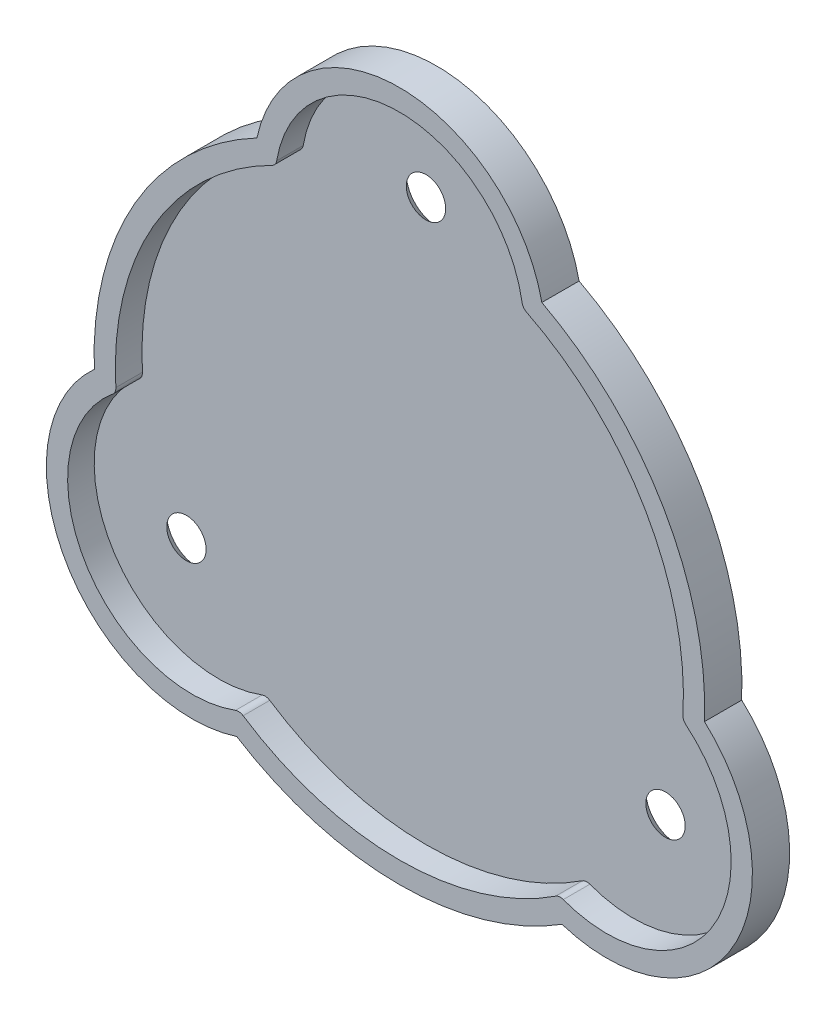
ISO-10303-21;
HEADER;
FILE_DESCRIPTION(('STEP AP214'),'2;1');
FILE_NAME('part.step','',(''),(''),'','','');
FILE_SCHEMA(('AUTOMOTIVE_DESIGN { 1 0 10303 214 1 1 1 1 }'));
ENDSEC;
DATA;
#1=APPLICATION_CONTEXT('core data for automotive mechanical design processes');
#2=APPLICATION_PROTOCOL_DEFINITION('international standard','automotive_design',2000,#1);
#3=PRODUCT_CONTEXT('',#1,'mechanical');
#4=PRODUCT('Part','Part','',(#3));
#5=PRODUCT_RELATED_PRODUCT_CATEGORY('part','',(#4));
#6=PRODUCT_DEFINITION_FORMATION('','',#4);
#7=PRODUCT_DEFINITION_CONTEXT('part definition',#1,'design');
#8=PRODUCT_DEFINITION('design','',#6,#7);
#9=PRODUCT_DEFINITION_SHAPE('','',#8);
#10=(LENGTH_UNIT() NAMED_UNIT(*) SI_UNIT(.MILLI.,.METRE.));
#11=(NAMED_UNIT(*) PLANE_ANGLE_UNIT() SI_UNIT($,.RADIAN.));
#12=(NAMED_UNIT(*) SI_UNIT($,.STERADIAN.) SOLID_ANGLE_UNIT());
#13=UNCERTAINTY_MEASURE_WITH_UNIT(LENGTH_MEASURE(1.E-05),#10,'distance_accuracy_value','');
#14=(GEOMETRIC_REPRESENTATION_CONTEXT(3) GLOBAL_UNCERTAINTY_ASSIGNED_CONTEXT((#13)) GLOBAL_UNIT_ASSIGNED_CONTEXT((#10,
#11,#12)) REPRESENTATION_CONTEXT('',''));
#15=CARTESIAN_POINT('',(0.,0.,0.));
#16=DIRECTION('',(0.,0.,1.));
#17=DIRECTION('',(1.,0.,0.));
#18=AXIS2_PLACEMENT_3D('',#15,#16,#17);
#19=CARTESIAN_POINT('',(1276.73296316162,1096.80329769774,1989.));
#20=DIRECTION('',(0.,0.,-1.));
#21=DIRECTION('',(-1.,0.,0.));
#22=AXIS2_PLACEMENT_3D('',#19,#20,#21);
#23=PLANE('',#22);
#24=CARTESIAN_POINT('',(1289.50683786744,1089.42829769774,1989.));
#25=DIRECTION('',(0.,0.,-1.));
#26=DIRECTION('',(-1.,0.,0.));
#27=AXIS2_PLACEMENT_3D('',#24,#25,#26);
#28=CIRCLE('',#27,2.8499999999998);
#29=CARTESIAN_POINT('',(1286.65683786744,1089.42829769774,1989.));
#30=VERTEX_POINT('',#29);
#31=EDGE_CURVE('E323',#30,#30,#28,.F.);
#32=ORIENTED_EDGE('',*,*,#31,.T.);
#33=EDGE_LOOP('',(#32));
#34=FACE_BOUND('',#33,.T.);
#35=CARTESIAN_POINT('',(1289.50683786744,1089.42829769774,1989.));
#36=DIRECTION('',(0.,0.,-1.));
#37=DIRECTION('',(-1.,0.,0.));
#38=AXIS2_PLACEMENT_3D('',#35,#36,#37);
#39=CIRCLE('',#38,5.25000000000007);
#40=CARTESIAN_POINT('',(1284.25683786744,1089.42829769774,1989.));
#41=VERTEX_POINT('',#40);
#42=EDGE_CURVE('E11',#41,#41,#39,.F.);
#43=ORIENTED_EDGE('',*,*,#42,.F.);
#44=EDGE_LOOP('',(#43));
#45=FACE_BOUND('',#44,.T.);
#46=ADVANCED_FACE('F39',(#34,#45),#23,.T.);
#47=CARTESIAN_POINT('',(1244.47351687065,1089.42829769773,1989.));
#48=DIRECTION('',(0.,0.,-1.));
#49=DIRECTION('',(-1.,0.,0.));
#50=AXIS2_PLACEMENT_3D('',#47,#48,#49);
#51=CIRCLE('',#50,2.8499999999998);
#52=CARTESIAN_POINT('',(1241.62351687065,1089.42829769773,1989.));
#53=VERTEX_POINT('',#52);
#54=EDGE_CURVE('E336',#53,#53,#51,.F.);
#55=ORIENTED_EDGE('',*,*,#54,.T.);
#56=EDGE_LOOP('',(#55));
#57=FACE_BOUND('',#56,.T.);
#58=CARTESIAN_POINT('',(1244.47351687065,1089.42829769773,1989.));
#59=DIRECTION('',(0.,0.,-1.));
#60=DIRECTION('',(-1.,0.,0.));
#61=AXIS2_PLACEMENT_3D('',#58,#59,#60);
#62=CIRCLE('',#61,5.25000000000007);
#63=CARTESIAN_POINT('',(1239.22351687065,1089.42829769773,1989.));
#64=VERTEX_POINT('',#63);
#65=EDGE_CURVE('E48',#64,#64,#62,.F.);
#66=ORIENTED_EDGE('',*,*,#65,.F.);
#67=EDGE_LOOP('',(#66));
#68=FACE_BOUND('',#67,.T.);
#69=ADVANCED_FACE('F346',(#57,#68),#23,.T.);
#70=CARTESIAN_POINT('',(1266.99017736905,1128.42829769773,1989.));
#71=DIRECTION('',(0.,0.,-1.));
#72=DIRECTION('',(-1.,0.,0.));
#73=AXIS2_PLACEMENT_3D('',#70,#71,#72);
#74=CIRCLE('',#73,2.8499999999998);
#75=CARTESIAN_POINT('',(1264.14017736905,1128.42829769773,1989.));
#76=VERTEX_POINT('',#75);
#77=EDGE_CURVE('E333',#76,#76,#74,.F.);
#78=ORIENTED_EDGE('',*,*,#77,.T.);
#79=EDGE_LOOP('',(#78));
#80=FACE_BOUND('',#79,.T.);
#81=CARTESIAN_POINT('',(1266.99017736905,1128.42829769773,1989.));
#82=DIRECTION('',(0.,0.,-1.));
#83=DIRECTION('',(-1.,0.,0.));
#84=AXIS2_PLACEMENT_3D('',#81,#82,#83);
#85=CIRCLE('',#84,5.25000000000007);
#86=CARTESIAN_POINT('',(1261.74017736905,1128.42829769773,1989.));
#87=VERTEX_POINT('',#86);
#88=EDGE_CURVE('E339',#87,#87,#85,.F.);
#89=ORIENTED_EDGE('',*,*,#88,.F.);
#90=EDGE_LOOP('',(#89));
#91=FACE_BOUND('',#90,.T.);
#92=ADVANCED_FACE('F348',(#80,#91),#23,.T.);
#93=CARTESIAN_POINT('',(1266.99017736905,1102.42829769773,1992.5));
#94=DIRECTION('',(0.,0.,-1.));
#95=DIRECTION('',(-1.,0.,0.));
#96=AXIS2_PLACEMENT_3D('',#93,#94,#95);
#97=CYLINDRICAL_SURFACE('',#96,28.7);
#98=DIRECTION('',(0.,0.,-1.));
#99=VECTOR('',#98,1.);
#100=CARTESIAN_POINT('',(1295.66936241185,1101.33543664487,1992.5));
#101=LINE('',#100,#99);
#102=CARTESIAN_POINT('',(1295.66936241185,1101.33543664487,1992.5));
#103=VERTEX_POINT('',#102);
#104=CARTESIAN_POINT('',(1295.66936241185,1101.33543664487,1989.));
#105=VERTEX_POINT('',#104);
#106=EDGE_CURVE('E164',#103,#105,#101,.T.);
#107=ORIENTED_EDGE('',*,*,#106,.T.);
#108=CARTESIAN_POINT('',(1266.99017736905,1102.42829769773,1989.));
#109=DIRECTION('',(0.,0.,-1.));
#110=DIRECTION('',(-1.,0.,0.));
#111=AXIS2_PLACEMENT_3D('',#108,#109,#110);
#112=CIRCLE('',#111,28.7);
#113=CARTESIAN_POINT('',(1280.38332445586,1127.81163103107,1989.));
#114=VERTEX_POINT('',#113);
#115=EDGE_CURVE('E168',#114,#105,#112,.T.);
#116=ORIENTED_EDGE('',*,*,#115,.F.);
#117=DIRECTION('',(0.,0.,-1.));
#118=VECTOR('',#117,1.);
#119=CARTESIAN_POINT('',(1280.38332445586,1127.81163103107,1992.5));
#120=LINE('',#119,#118);
#121=CARTESIAN_POINT('',(1280.38332445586,1127.81163103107,1992.5));
#122=VERTEX_POINT('',#121);
#123=EDGE_CURVE('E63',#122,#114,#120,.T.);
#124=ORIENTED_EDGE('',*,*,#123,.F.);
#125=CARTESIAN_POINT('',(1266.99017736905,1102.42829769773,1992.5));
#126=DIRECTION('',(0.,0.,-1.));
#127=DIRECTION('',(-1.,0.,0.));
#128=AXIS2_PLACEMENT_3D('',#125,#126,#127);
#129=CIRCLE('',#128,28.7);
#130=EDGE_CURVE('E169',#122,#103,#129,.T.);
#131=ORIENTED_EDGE('',*,*,#130,.T.);
#132=EDGE_LOOP('',(#107,#116,#124,#131));
#133=FACE_BOUND('',#132,.T.);
#134=ADVANCED_FACE('F166',(#133),#97,.T.);
#135=CARTESIAN_POINT('',(1266.99017736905,1124.92829769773,1992.5));
#136=DIRECTION('',(0.,0.,-1.));
#137=DIRECTION('',(-1.,0.,0.));
#138=AXIS2_PLACEMENT_3D('',#135,#136,#137);
#139=CYLINDRICAL_SURFACE('',#138,13.6999999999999);
#140=ORIENTED_EDGE('',*,*,#123,.T.);
#141=CARTESIAN_POINT('',(1266.99017736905,1124.92829769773,1989.));
#142=DIRECTION('',(0.,0.,-1.));
#143=DIRECTION('',(-1.,0.,0.));
#144=AXIS2_PLACEMENT_3D('',#141,#142,#143);
#145=CIRCLE('',#144,13.6999999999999);
#146=CARTESIAN_POINT('',(1253.59703028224,1127.81163103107,1989.));
#147=VERTEX_POINT('',#146);
#148=EDGE_CURVE('E188',#147,#114,#145,.T.);
#149=ORIENTED_EDGE('',*,*,#148,.F.);
#150=DIRECTION('',(0.,0.,-1.));
#151=VECTOR('',#150,1.);
#152=CARTESIAN_POINT('',(1253.59703028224,1127.81163103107,1992.5));
#153=LINE('',#152,#151);
#154=CARTESIAN_POINT('',(1253.59703028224,1127.81163103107,1992.5));
#155=VERTEX_POINT('',#154);
#156=EDGE_CURVE('E324',#155,#147,#153,.T.);
#157=ORIENTED_EDGE('',*,*,#156,.F.);
#158=CARTESIAN_POINT('',(1266.99017736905,1124.92829769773,1992.5));
#159=DIRECTION('',(0.,0.,-1.));
#160=DIRECTION('',(-1.,0.,0.));
#161=AXIS2_PLACEMENT_3D('',#158,#159,#160);
#162=CIRCLE('',#161,13.6999999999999);
#163=EDGE_CURVE('E174',#155,#122,#162,.T.);
#164=ORIENTED_EDGE('',*,*,#163,.T.);
#165=EDGE_LOOP('',(#140,#149,#157,#164));
#166=FACE_BOUND('',#165,.T.);
#167=ADVANCED_FACE('F419',(#166),#139,.T.);
#168=CARTESIAN_POINT('',(1266.99017736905,1102.42829769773,1992.5));
#169=DIRECTION('',(0.,0.,-1.));
#170=DIRECTION('',(-1.,0.,0.));
#171=AXIS2_PLACEMENT_3D('',#168,#169,#170);
#172=CYLINDRICAL_SURFACE('',#171,28.7);
#173=ORIENTED_EDGE('',*,*,#156,.T.);
#174=CARTESIAN_POINT('',(1266.99017736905,1102.42829769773,1989.));
#175=DIRECTION('',(0.,0.,-1.));
#176=DIRECTION('',(-1.,0.,0.));
#177=AXIS2_PLACEMENT_3D('',#174,#175,#176);
#178=CIRCLE('',#177,28.7);
#179=CARTESIAN_POINT('',(1238.31099232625,1101.33543664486,1989.));
#180=VERTEX_POINT('',#179);
#181=EDGE_CURVE('E200',#180,#147,#178,.T.);
#182=ORIENTED_EDGE('',*,*,#181,.F.);
#183=DIRECTION('',(0.,0.,-1.));
#184=VECTOR('',#183,1.);
#185=CARTESIAN_POINT('',(1238.31099232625,1101.33543664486,1992.5));
#186=LINE('',#185,#184);
#187=CARTESIAN_POINT('',(1238.31099232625,1101.33543664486,1992.5));
#188=VERTEX_POINT('',#187);
#189=EDGE_CURVE('E326',#188,#180,#186,.T.);
#190=ORIENTED_EDGE('',*,*,#189,.F.);
#191=CARTESIAN_POINT('',(1266.99017736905,1102.42829769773,1992.5));
#192=DIRECTION('',(0.,0.,-1.));
#193=DIRECTION('',(-1.,0.,0.));
#194=AXIS2_PLACEMENT_3D('',#191,#192,#193);
#195=CIRCLE('',#194,28.7);
#196=EDGE_CURVE('E317',#188,#155,#195,.T.);
#197=ORIENTED_EDGE('',*,*,#196,.T.);
#198=EDGE_LOOP('',(#173,#182,#190,#197));
#199=FACE_BOUND('',#198,.T.);
#200=ADVANCED_FACE('F422',(#199),#172,.T.);
#201=CARTESIAN_POINT('',(1247.5046057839,1091.17829769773,1992.5));
#202=DIRECTION('',(0.,0.,-1.));
#203=DIRECTION('',(-1.,0.,0.));
#204=AXIS2_PLACEMENT_3D('',#201,#202,#203);
#205=CYLINDRICAL_SURFACE('',#204,13.7);
#206=ORIENTED_EDGE('',*,*,#189,.T.);
#207=CARTESIAN_POINT('',(1247.5046057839,1091.17829769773,1989.));
#208=DIRECTION('',(0.,0.,-1.));
#209=DIRECTION('',(-1.,0.,0.));
#210=AXIS2_PLACEMENT_3D('',#207,#208,#209);
#211=CIRCLE('',#210,13.7);
#212=CARTESIAN_POINT('',(1251.70413941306,1078.13782541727,1989.));
#213=VERTEX_POINT('',#212);
#214=EDGE_CURVE('E197',#213,#180,#211,.T.);
#215=ORIENTED_EDGE('',*,*,#214,.F.);
#216=DIRECTION('',(0.,0.,-1.));
#217=VECTOR('',#216,1.);
#218=CARTESIAN_POINT('',(1251.70413941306,1078.13782541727,1992.5));
#219=LINE('',#218,#217);
#220=CARTESIAN_POINT('',(1251.70413941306,1078.13782541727,1992.5));
#221=VERTEX_POINT('',#220);
#222=EDGE_CURVE('E328',#221,#213,#219,.T.);
#223=ORIENTED_EDGE('',*,*,#222,.F.);
#224=CARTESIAN_POINT('',(1247.5046057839,1091.17829769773,1992.5));
#225=DIRECTION('',(0.,0.,-1.));
#226=DIRECTION('',(-1.,0.,0.));
#227=AXIS2_PLACEMENT_3D('',#224,#225,#226);
#228=CIRCLE('',#227,13.7);
#229=EDGE_CURVE('E314',#221,#188,#228,.T.);
#230=ORIENTED_EDGE('',*,*,#229,.T.);
#231=EDGE_LOOP('',(#206,#215,#223,#230));
#232=FACE_BOUND('',#231,.T.);
#233=ADVANCED_FACE('F426',(#232),#205,.T.);
#234=CARTESIAN_POINT('',(1266.99017736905,1102.42829769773,1992.5));
#235=DIRECTION('',(0.,0.,-1.));
#236=DIRECTION('',(-1.,0.,0.));
#237=AXIS2_PLACEMENT_3D('',#234,#235,#236);
#238=CYLINDRICAL_SURFACE('',#237,28.7);
#239=ORIENTED_EDGE('',*,*,#222,.T.);
#240=CARTESIAN_POINT('',(1266.99017736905,1102.42829769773,1989.));
#241=DIRECTION('',(0.,0.,-1.));
#242=DIRECTION('',(-1.,0.,0.));
#243=AXIS2_PLACEMENT_3D('',#240,#241,#242);
#244=CIRCLE('',#243,28.7);
#245=CARTESIAN_POINT('',(1282.27621532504,1078.13782541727,1989.));
#246=VERTEX_POINT('',#245);
#247=EDGE_CURVE('E182',#246,#213,#244,.T.);
#248=ORIENTED_EDGE('',*,*,#247,.F.);
#249=DIRECTION('',(0.,0.,-1.));
#250=VECTOR('',#249,1.);
#251=CARTESIAN_POINT('',(1282.27621532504,1078.13782541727,1992.5));
#252=LINE('',#251,#250);
#253=CARTESIAN_POINT('',(1282.27621532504,1078.13782541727,1992.5));
#254=VERTEX_POINT('',#253);
#255=EDGE_CURVE('E173',#254,#246,#252,.T.);
#256=ORIENTED_EDGE('',*,*,#255,.F.);
#257=CARTESIAN_POINT('',(1266.99017736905,1102.42829769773,1992.5));
#258=DIRECTION('',(0.,0.,-1.));
#259=DIRECTION('',(-1.,0.,0.));
#260=AXIS2_PLACEMENT_3D('',#257,#258,#259);
#261=CIRCLE('',#260,28.7);
#262=EDGE_CURVE('E311',#254,#221,#261,.T.);
#263=ORIENTED_EDGE('',*,*,#262,.T.);
#264=EDGE_LOOP('',(#239,#248,#256,#263));
#265=FACE_BOUND('',#264,.T.);
#266=ADVANCED_FACE('F430',(#265),#238,.T.);
#267=CARTESIAN_POINT('',(1286.4757489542,1091.17829769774,1992.5));
#268=DIRECTION('',(0.,0.,-1.));
#269=DIRECTION('',(-1.,0.,0.));
#270=AXIS2_PLACEMENT_3D('',#267,#268,#269);
#271=CYLINDRICAL_SURFACE('',#270,13.7000000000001);
#272=ORIENTED_EDGE('',*,*,#255,.T.);
#273=CARTESIAN_POINT('',(1286.4757489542,1091.17829769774,1989.));
#274=DIRECTION('',(0.,0.,-1.));
#275=DIRECTION('',(-1.,0.,0.));
#276=AXIS2_PLACEMENT_3D('',#273,#274,#275);
#277=CIRCLE('',#276,13.7000000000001);
#278=EDGE_CURVE('E177',#105,#246,#277,.T.);
#279=ORIENTED_EDGE('',*,*,#278,.F.);
#280=ORIENTED_EDGE('',*,*,#106,.F.);
#281=CARTESIAN_POINT('',(1286.4757489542,1091.17829769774,1992.5));
#282=DIRECTION('',(0.,0.,-1.));
#283=DIRECTION('',(-1.,0.,0.));
#284=AXIS2_PLACEMENT_3D('',#281,#282,#283);
#285=CIRCLE('',#284,13.7000000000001);
#286=EDGE_CURVE('E309',#103,#254,#285,.T.);
#287=ORIENTED_EDGE('',*,*,#286,.T.);
#288=EDGE_LOOP('',(#272,#279,#280,#287));
#289=FACE_BOUND('',#288,.T.);
#290=ADVANCED_FACE('F178',(#289),#271,.T.);
#291=CARTESIAN_POINT('',(1276.73296316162,1096.80329769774,1992.5));
#292=DIRECTION('',(0.,0.,-1.));
#293=DIRECTION('',(-1.,0.,0.));
#294=AXIS2_PLACEMENT_3D('',#291,#292,#293);
#295=PLANE('',#294);
#296=CARTESIAN_POINT('',(1279.31534358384,1127.01163103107,1992.5));
#297=DIRECTION('',(0.,0.,1.));
#298=DIRECTION('',(-1.,0.,0.));
#299=AXIS2_PLACEMENT_3D('',#296,#297,#298);
#300=CIRCLE('',#299,0.800000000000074);
#301=CARTESIAN_POINT('',(1278.52653294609,1126.87829769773,1992.5));
#302=VERTEX_POINT('',#301);
#303=CARTESIAN_POINT('',(1278.95679329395,1126.29647951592,1992.5));
#304=VERTEX_POINT('',#303);
#305=EDGE_CURVE('E236',#302,#304,#300,.T.);
#306=ORIENTED_EDGE('',*,*,#305,.T.);
#307=CARTESIAN_POINT('',(1266.99017736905,1102.42829769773,1992.5));
#308=DIRECTION('',(0.,0.,-1.));
#309=DIRECTION('',(-1.,0.,0.));
#310=AXIS2_PLACEMENT_3D('',#307,#308,#309);
#311=CIRCLE('',#310,26.7);
#312=CARTESIAN_POINT('',(1293.64393712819,1100.85760017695,1992.5));
#313=VERTEX_POINT('',#312);
#314=EDGE_CURVE('E204',#304,#313,#311,.T.);
#315=ORIENTED_EDGE('',*,*,#314,.T.);
#316=CARTESIAN_POINT('',(1294.44255165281,1100.81053807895,1992.5));
#317=DIRECTION('',(0.,0.,1.));
#318=DIRECTION('',(-1.,0.,0.));
#319=AXIS2_PLACEMENT_3D('',#316,#317,#318);
#320=CIRCLE('',#319,0.799999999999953);
#321=CARTESIAN_POINT('',(1293.9326762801,1100.19407469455,1992.5));
#322=VERTEX_POINT('',#321);
#323=EDGE_CURVE('E207',#313,#322,#320,.T.);
#324=ORIENTED_EDGE('',*,*,#323,.T.);
#325=CARTESIAN_POINT('',(1286.4757489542,1091.17829769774,1992.5));
#326=DIRECTION('',(0.,0.,-1.));
#327=DIRECTION('',(-1.,0.,0.));
#328=AXIS2_PLACEMENT_3D('',#325,#326,#327);
#329=CIRCLE('',#328,11.7000000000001);
#330=CARTESIAN_POINT('',(1282.39632070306,1080.21252070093,1992.5));
#331=VERTEX_POINT('',#330);
#332=EDGE_CURVE('E55',#322,#331,#329,.T.);
#333=ORIENTED_EDGE('',*,*,#332,.T.);
#334=CARTESIAN_POINT('',(1282.11738543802,1079.4627239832,1992.5));
#335=DIRECTION('',(0.,0.,1.));
#336=DIRECTION('',(-1.,0.,0.));
#337=AXIS2_PLACEMENT_3D('',#334,#335,#336);
#338=CIRCLE('',#337,0.799999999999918);
#339=CARTESIAN_POINT('',(1281.67732120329,1080.13081340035,1992.5));
#340=VERTEX_POINT('',#339);
#341=EDGE_CURVE('E212',#331,#340,#338,.T.);
#342=ORIENTED_EDGE('',*,*,#341,.T.);
#343=CARTESIAN_POINT('',(1266.99017736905,1102.42829769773,1992.5));
#344=DIRECTION('',(0.,0.,-1.));
#345=DIRECTION('',(-1.,0.,0.));
#346=AXIS2_PLACEMENT_3D('',#343,#344,#345);
#347=CIRCLE('',#346,26.7);
#348=CARTESIAN_POINT('',(1252.30303353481,1080.13081340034,1992.5));
#349=VERTEX_POINT('',#348);
#350=EDGE_CURVE('E215',#340,#349,#347,.T.);
#351=ORIENTED_EDGE('',*,*,#350,.T.);
#352=CARTESIAN_POINT('',(1251.86296930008,1079.46272398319,1992.5));
#353=DIRECTION('',(0.,0.,1.));
#354=DIRECTION('',(-1.,0.,0.));
#355=AXIS2_PLACEMENT_3D('',#352,#353,#354);
#356=CIRCLE('',#355,0.799999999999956);
#357=CARTESIAN_POINT('',(1251.58403403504,1080.21252070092,1992.5));
#358=VERTEX_POINT('',#357);
#359=EDGE_CURVE('E218',#349,#358,#356,.T.);
#360=ORIENTED_EDGE('',*,*,#359,.T.);
#361=CARTESIAN_POINT('',(1247.5046057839,1091.17829769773,1992.5));
#362=DIRECTION('',(0.,0.,-1.));
#363=DIRECTION('',(-1.,0.,0.));
#364=AXIS2_PLACEMENT_3D('',#361,#362,#363);
#365=CIRCLE('',#364,11.7000000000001);
#366=CARTESIAN_POINT('',(1240.047678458,1100.19407469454,1992.5));
#367=VERTEX_POINT('',#366);
#368=EDGE_CURVE('E221',#358,#367,#365,.T.);
#369=ORIENTED_EDGE('',*,*,#368,.T.);
#370=CARTESIAN_POINT('',(1239.53780308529,1100.81053807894,1992.5));
#371=DIRECTION('',(0.,0.,1.));
#372=DIRECTION('',(-1.,0.,0.));
#373=AXIS2_PLACEMENT_3D('',#370,#371,#372);
#374=CIRCLE('',#373,0.800000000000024);
#375=CARTESIAN_POINT('',(1240.3364176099,1100.85760017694,1992.5));
#376=VERTEX_POINT('',#375);
#377=EDGE_CURVE('E224',#367,#376,#374,.T.);
#378=ORIENTED_EDGE('',*,*,#377,.T.);
#379=CARTESIAN_POINT('',(1266.99017736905,1102.42829769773,1992.5));
#380=DIRECTION('',(0.,0.,-1.));
#381=DIRECTION('',(-1.,0.,0.));
#382=AXIS2_PLACEMENT_3D('',#379,#380,#381);
#383=CIRCLE('',#382,26.7);
#384=CARTESIAN_POINT('',(1255.02356144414,1126.29647951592,1992.5));
#385=VERTEX_POINT('',#384);
#386=EDGE_CURVE('E227',#376,#385,#383,.T.);
#387=ORIENTED_EDGE('',*,*,#386,.T.);
#388=CARTESIAN_POINT('',(1254.66501115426,1127.01163103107,1992.5));
#389=DIRECTION('',(0.,0.,1.));
#390=DIRECTION('',(-1.,0.,0.));
#391=AXIS2_PLACEMENT_3D('',#388,#389,#390);
#392=CIRCLE('',#391,0.800000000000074);
#393=CARTESIAN_POINT('',(1255.453821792,1126.87829769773,1992.5));
#394=VERTEX_POINT('',#393);
#395=EDGE_CURVE('E230',#385,#394,#392,.T.);
#396=ORIENTED_EDGE('',*,*,#395,.T.);
#397=CARTESIAN_POINT('',(1266.99017736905,1124.92829769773,1992.5));
#398=DIRECTION('',(0.,0.,-1.));
#399=DIRECTION('',(-1.,0.,0.));
#400=AXIS2_PLACEMENT_3D('',#397,#398,#399);
#401=CIRCLE('',#400,11.7);
#402=EDGE_CURVE('E233',#394,#302,#401,.T.);
#403=ORIENTED_EDGE('',*,*,#402,.T.);
#404=EDGE_LOOP('',(#306,#315,#324,#333,#342,#351,#360,#369,#378,#387,#396,#403));
#405=FACE_BOUND('',#404,.T.);
#406=ORIENTED_EDGE('',*,*,#130,.F.);
#407=ORIENTED_EDGE('',*,*,#163,.F.);
#408=ORIENTED_EDGE('',*,*,#196,.F.);
#409=ORIENTED_EDGE('',*,*,#229,.F.);
#410=ORIENTED_EDGE('',*,*,#262,.F.);
#411=ORIENTED_EDGE('',*,*,#286,.F.);
#412=EDGE_LOOP('',(#406,#407,#408,#409,#410,#411));
#413=FACE_BOUND('',#412,.T.);
#414=ADVANCED_FACE('F414',(#405,#413),#295,.F.);
#415=CARTESIAN_POINT('',(1266.99017736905,1102.42829769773,1992.5));
#416=DIRECTION('',(0.,0.,-1.));
#417=DIRECTION('',(-1.,0.,0.));
#418=AXIS2_PLACEMENT_3D('',#415,#416,#417);
#419=CYLINDRICAL_SURFACE('',#418,26.7);
#420=CARTESIAN_POINT('',(1266.99017736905,1102.42829769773,1990.));
#421=DIRECTION('',(0.,0.,-1.));
#422=DIRECTION('',(-1.,0.,0.));
#423=AXIS2_PLACEMENT_3D('',#420,#421,#422);
#424=CIRCLE('',#423,26.7);
#425=CARTESIAN_POINT('',(1278.95679329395,1126.29647951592,1990.));
#426=VERTEX_POINT('',#425);
#427=CARTESIAN_POINT('',(1293.64393712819,1100.85760017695,1990.));
#428=VERTEX_POINT('',#427);
#429=EDGE_CURVE('E203',#426,#428,#424,.T.);
#430=ORIENTED_EDGE('',*,*,#429,.T.);
#431=DIRECTION('',(0.,0.,-1.));
#432=VECTOR('',#431,1.);
#433=CARTESIAN_POINT('',(1293.64393712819,1100.85760017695,1992.5));
#434=LINE('',#433,#432);
#435=EDGE_CURVE('E239',#313,#428,#434,.T.);
#436=ORIENTED_EDGE('',*,*,#435,.F.);
#437=ORIENTED_EDGE('',*,*,#314,.F.);
#438=DIRECTION('',(0.,0.,-1.));
#439=VECTOR('',#438,1.);
#440=CARTESIAN_POINT('',(1278.95679329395,1126.29647951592,1992.5));
#441=LINE('',#440,#439);
#442=EDGE_CURVE('E274',#304,#426,#441,.T.);
#443=ORIENTED_EDGE('',*,*,#442,.T.);
#444=EDGE_LOOP('',(#430,#436,#437,#443));
#445=FACE_BOUND('',#444,.T.);
#446=ADVANCED_FACE('F373',(#445),#419,.F.);
#447=CARTESIAN_POINT('',(1279.31534358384,1127.01163103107,1992.5));
#448=DIRECTION('',(0.,0.,-1.));
#449=DIRECTION('',(-1.,0.,0.));
#450=AXIS2_PLACEMENT_3D('',#447,#448,#449);
#451=CYLINDRICAL_SURFACE('',#450,0.800000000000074);
#452=CARTESIAN_POINT('',(1279.31534358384,1127.01163103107,1990.));
#453=DIRECTION('',(0.,0.,1.));
#454=DIRECTION('',(-1.,0.,0.));
#455=AXIS2_PLACEMENT_3D('',#452,#453,#454);
#456=CIRCLE('',#455,0.800000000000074);
#457=CARTESIAN_POINT('',(1278.52653294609,1126.87829769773,1990.));
#458=VERTEX_POINT('',#457);
#459=EDGE_CURVE('E208',#458,#426,#456,.T.);
#460=ORIENTED_EDGE('',*,*,#459,.T.);
#461=ORIENTED_EDGE('',*,*,#442,.F.);
#462=ORIENTED_EDGE('',*,*,#305,.F.);
#463=DIRECTION('',(0.,0.,-1.));
#464=VECTOR('',#463,1.);
#465=CARTESIAN_POINT('',(1278.52653294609,1126.87829769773,1992.5));
#466=LINE('',#465,#464);
#467=EDGE_CURVE('E277',#302,#458,#466,.T.);
#468=ORIENTED_EDGE('',*,*,#467,.T.);
#469=EDGE_LOOP('',(#460,#461,#462,#468));
#470=FACE_BOUND('',#469,.T.);
#471=ADVANCED_FACE('F369',(#470),#451,.T.);
#472=CARTESIAN_POINT('',(1266.99017736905,1124.92829769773,1992.5));
#473=DIRECTION('',(0.,0.,-1.));
#474=DIRECTION('',(-1.,0.,0.));
#475=AXIS2_PLACEMENT_3D('',#472,#473,#474);
#476=CYLINDRICAL_SURFACE('',#475,11.7);
#477=CARTESIAN_POINT('',(1266.99017736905,1124.92829769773,1990.));
#478=DIRECTION('',(0.,0.,-1.));
#479=DIRECTION('',(-1.,0.,0.));
#480=AXIS2_PLACEMENT_3D('',#477,#478,#479);
#481=CIRCLE('',#480,11.7);
#482=CARTESIAN_POINT('',(1255.453821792,1126.87829769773,1990.));
#483=VERTEX_POINT('',#482);
#484=EDGE_CURVE('E269',#483,#458,#481,.T.);
#485=ORIENTED_EDGE('',*,*,#484,.T.);
#486=ORIENTED_EDGE('',*,*,#467,.F.);
#487=ORIENTED_EDGE('',*,*,#402,.F.);
#488=DIRECTION('',(0.,0.,-1.));
#489=VECTOR('',#488,1.);
#490=CARTESIAN_POINT('',(1255.453821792,1126.87829769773,1992.5));
#491=LINE('',#490,#489);
#492=EDGE_CURVE('E280',#394,#483,#491,.T.);
#493=ORIENTED_EDGE('',*,*,#492,.T.);
#494=EDGE_LOOP('',(#485,#486,#487,#493));
#495=FACE_BOUND('',#494,.T.);
#496=ADVANCED_FACE('F372',(#495),#476,.F.);
#497=CARTESIAN_POINT('',(1254.66501115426,1127.01163103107,1992.5));
#498=DIRECTION('',(0.,0.,-1.));
#499=DIRECTION('',(-1.,0.,0.));
#500=AXIS2_PLACEMENT_3D('',#497,#498,#499);
#501=CYLINDRICAL_SURFACE('',#500,0.800000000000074);
#502=CARTESIAN_POINT('',(1254.66501115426,1127.01163103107,1990.));
#503=DIRECTION('',(0.,0.,1.));
#504=DIRECTION('',(-1.,0.,0.));
#505=AXIS2_PLACEMENT_3D('',#502,#503,#504);
#506=CIRCLE('',#505,0.800000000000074);
#507=CARTESIAN_POINT('',(1255.02356144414,1126.29647951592,1990.));
#508=VERTEX_POINT('',#507);
#509=EDGE_CURVE('E266',#508,#483,#506,.T.);
#510=ORIENTED_EDGE('',*,*,#509,.T.);
#511=ORIENTED_EDGE('',*,*,#492,.F.);
#512=ORIENTED_EDGE('',*,*,#395,.F.);
#513=DIRECTION('',(0.,0.,-1.));
#514=VECTOR('',#513,1.);
#515=CARTESIAN_POINT('',(1255.02356144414,1126.29647951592,1992.5));
#516=LINE('',#515,#514);
#517=EDGE_CURVE('E283',#385,#508,#516,.T.);
#518=ORIENTED_EDGE('',*,*,#517,.T.);
#519=EDGE_LOOP('',(#510,#511,#512,#518));
#520=FACE_BOUND('',#519,.T.);
#521=ADVANCED_FACE('F377',(#520),#501,.T.);
#522=CARTESIAN_POINT('',(1266.99017736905,1102.42829769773,1992.5));
#523=DIRECTION('',(0.,0.,-1.));
#524=DIRECTION('',(-1.,0.,0.));
#525=AXIS2_PLACEMENT_3D('',#522,#523,#524);
#526=CYLINDRICAL_SURFACE('',#525,26.7);
#527=CARTESIAN_POINT('',(1266.99017736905,1102.42829769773,1990.));
#528=DIRECTION('',(0.,0.,-1.));
#529=DIRECTION('',(-1.,0.,0.));
#530=AXIS2_PLACEMENT_3D('',#527,#528,#529);
#531=CIRCLE('',#530,26.7);
#532=CARTESIAN_POINT('',(1240.3364176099,1100.85760017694,1990.));
#533=VERTEX_POINT('',#532);
#534=EDGE_CURVE('E263',#533,#508,#531,.T.);
#535=ORIENTED_EDGE('',*,*,#534,.T.);
#536=ORIENTED_EDGE('',*,*,#517,.F.);
#537=ORIENTED_EDGE('',*,*,#386,.F.);
#538=DIRECTION('',(0.,0.,-1.));
#539=VECTOR('',#538,1.);
#540=CARTESIAN_POINT('',(1240.3364176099,1100.85760017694,1992.5));
#541=LINE('',#540,#539);
#542=EDGE_CURVE('E286',#376,#533,#541,.T.);
#543=ORIENTED_EDGE('',*,*,#542,.T.);
#544=EDGE_LOOP('',(#535,#536,#537,#543));
#545=FACE_BOUND('',#544,.T.);
#546=ADVANCED_FACE('F381',(#545),#526,.F.);
#547=CARTESIAN_POINT('',(1239.53780308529,1100.81053807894,1992.5));
#548=DIRECTION('',(0.,0.,-1.));
#549=DIRECTION('',(-1.,0.,0.));
#550=AXIS2_PLACEMENT_3D('',#547,#548,#549);
#551=CYLINDRICAL_SURFACE('',#550,0.800000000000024);
#552=CARTESIAN_POINT('',(1239.53780308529,1100.81053807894,1990.));
#553=DIRECTION('',(0.,0.,1.));
#554=DIRECTION('',(-1.,0.,0.));
#555=AXIS2_PLACEMENT_3D('',#552,#553,#554);
#556=CIRCLE('',#555,0.800000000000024);
#557=CARTESIAN_POINT('',(1240.047678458,1100.19407469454,1990.));
#558=VERTEX_POINT('',#557);
#559=EDGE_CURVE('E260',#558,#533,#556,.T.);
#560=ORIENTED_EDGE('',*,*,#559,.T.);
#561=ORIENTED_EDGE('',*,*,#542,.F.);
#562=ORIENTED_EDGE('',*,*,#377,.F.);
#563=DIRECTION('',(0.,0.,-1.));
#564=VECTOR('',#563,1.);
#565=CARTESIAN_POINT('',(1240.047678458,1100.19407469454,1992.5));
#566=LINE('',#565,#564);
#567=EDGE_CURVE('E289',#367,#558,#566,.T.);
#568=ORIENTED_EDGE('',*,*,#567,.T.);
#569=EDGE_LOOP('',(#560,#561,#562,#568));
#570=FACE_BOUND('',#569,.T.);
#571=ADVANCED_FACE('F385',(#570),#551,.T.);
#572=CARTESIAN_POINT('',(1247.5046057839,1091.17829769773,1992.5));
#573=DIRECTION('',(0.,0.,-1.));
#574=DIRECTION('',(-1.,0.,0.));
#575=AXIS2_PLACEMENT_3D('',#572,#573,#574);
#576=CYLINDRICAL_SURFACE('',#575,11.7000000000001);
#577=CARTESIAN_POINT('',(1247.5046057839,1091.17829769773,1990.));
#578=DIRECTION('',(0.,0.,-1.));
#579=DIRECTION('',(-1.,0.,0.));
#580=AXIS2_PLACEMENT_3D('',#577,#578,#579);
#581=CIRCLE('',#580,11.7000000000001);
#582=CARTESIAN_POINT('',(1251.58403403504,1080.21252070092,1990.));
#583=VERTEX_POINT('',#582);
#584=EDGE_CURVE('E257',#583,#558,#581,.T.);
#585=ORIENTED_EDGE('',*,*,#584,.T.);
#586=ORIENTED_EDGE('',*,*,#567,.F.);
#587=ORIENTED_EDGE('',*,*,#368,.F.);
#588=DIRECTION('',(0.,0.,-1.));
#589=VECTOR('',#588,1.);
#590=CARTESIAN_POINT('',(1251.58403403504,1080.21252070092,1992.5));
#591=LINE('',#590,#589);
#592=EDGE_CURVE('E292',#358,#583,#591,.T.);
#593=ORIENTED_EDGE('',*,*,#592,.T.);
#594=EDGE_LOOP('',(#585,#586,#587,#593));
#595=FACE_BOUND('',#594,.T.);
#596=ADVANCED_FACE('F389',(#595),#576,.F.);
#597=CARTESIAN_POINT('',(1251.86296930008,1079.46272398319,1992.5));
#598=DIRECTION('',(0.,0.,-1.));
#599=DIRECTION('',(-1.,0.,0.));
#600=AXIS2_PLACEMENT_3D('',#597,#598,#599);
#601=CYLINDRICAL_SURFACE('',#600,0.799999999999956);
#602=CARTESIAN_POINT('',(1251.86296930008,1079.46272398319,1990.));
#603=DIRECTION('',(0.,0.,1.));
#604=DIRECTION('',(-1.,0.,0.));
#605=AXIS2_PLACEMENT_3D('',#602,#603,#604);
#606=CIRCLE('',#605,0.799999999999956);
#607=CARTESIAN_POINT('',(1252.30303353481,1080.13081340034,1990.));
#608=VERTEX_POINT('',#607);
#609=EDGE_CURVE('E254',#608,#583,#606,.T.);
#610=ORIENTED_EDGE('',*,*,#609,.T.);
#611=ORIENTED_EDGE('',*,*,#592,.F.);
#612=ORIENTED_EDGE('',*,*,#359,.F.);
#613=DIRECTION('',(0.,0.,-1.));
#614=VECTOR('',#613,1.);
#615=CARTESIAN_POINT('',(1252.30303353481,1080.13081340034,1992.5));
#616=LINE('',#615,#614);
#617=EDGE_CURVE('E295',#349,#608,#616,.T.);
#618=ORIENTED_EDGE('',*,*,#617,.T.);
#619=EDGE_LOOP('',(#610,#611,#612,#618));
#620=FACE_BOUND('',#619,.T.);
#621=ADVANCED_FACE('F393',(#620),#601,.T.);
#622=CARTESIAN_POINT('',(1266.99017736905,1102.42829769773,1992.5));
#623=DIRECTION('',(0.,0.,-1.));
#624=DIRECTION('',(-1.,0.,0.));
#625=AXIS2_PLACEMENT_3D('',#622,#623,#624);
#626=CYLINDRICAL_SURFACE('',#625,26.7);
#627=CARTESIAN_POINT('',(1266.99017736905,1102.42829769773,1990.));
#628=DIRECTION('',(0.,0.,-1.));
#629=DIRECTION('',(-1.,0.,0.));
#630=AXIS2_PLACEMENT_3D('',#627,#628,#629);
#631=CIRCLE('',#630,26.7);
#632=CARTESIAN_POINT('',(1281.67732120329,1080.13081340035,1990.));
#633=VERTEX_POINT('',#632);
#634=EDGE_CURVE('E251',#633,#608,#631,.T.);
#635=ORIENTED_EDGE('',*,*,#634,.T.);
#636=ORIENTED_EDGE('',*,*,#617,.F.);
#637=ORIENTED_EDGE('',*,*,#350,.F.);
#638=DIRECTION('',(0.,0.,-1.));
#639=VECTOR('',#638,1.);
#640=CARTESIAN_POINT('',(1281.67732120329,1080.13081340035,1992.5));
#641=LINE('',#640,#639);
#642=EDGE_CURVE('E298',#340,#633,#641,.T.);
#643=ORIENTED_EDGE('',*,*,#642,.T.);
#644=EDGE_LOOP('',(#635,#636,#637,#643));
#645=FACE_BOUND('',#644,.T.);
#646=ADVANCED_FACE('F397',(#645),#626,.F.);
#647=CARTESIAN_POINT('',(1282.11738543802,1079.4627239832,1992.5));
#648=DIRECTION('',(0.,0.,-1.));
#649=DIRECTION('',(-1.,0.,0.));
#650=AXIS2_PLACEMENT_3D('',#647,#648,#649);
#651=CYLINDRICAL_SURFACE('',#650,0.799999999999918);
#652=CARTESIAN_POINT('',(1282.11738543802,1079.4627239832,1990.));
#653=DIRECTION('',(0.,0.,1.));
#654=DIRECTION('',(-1.,0.,0.));
#655=AXIS2_PLACEMENT_3D('',#652,#653,#654);
#656=CIRCLE('',#655,0.799999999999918);
#657=CARTESIAN_POINT('',(1282.39632070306,1080.21252070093,1990.));
#658=VERTEX_POINT('',#657);
#659=EDGE_CURVE('E248',#658,#633,#656,.T.);
#660=ORIENTED_EDGE('',*,*,#659,.T.);
#661=ORIENTED_EDGE('',*,*,#642,.F.);
#662=ORIENTED_EDGE('',*,*,#341,.F.);
#663=DIRECTION('',(0.,0.,-1.));
#664=VECTOR('',#663,1.);
#665=CARTESIAN_POINT('',(1282.39632070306,1080.21252070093,1992.5));
#666=LINE('',#665,#664);
#667=EDGE_CURVE('E301',#331,#658,#666,.T.);
#668=ORIENTED_EDGE('',*,*,#667,.T.);
#669=EDGE_LOOP('',(#660,#661,#662,#668));
#670=FACE_BOUND('',#669,.T.);
#671=ADVANCED_FACE('F401',(#670),#651,.T.);
#672=CARTESIAN_POINT('',(1286.4757489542,1091.17829769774,1992.5));
#673=DIRECTION('',(0.,0.,-1.));
#674=DIRECTION('',(-1.,0.,0.));
#675=AXIS2_PLACEMENT_3D('',#672,#673,#674);
#676=CYLINDRICAL_SURFACE('',#675,11.7000000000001);
#677=CARTESIAN_POINT('',(1286.4757489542,1091.17829769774,1990.));
#678=DIRECTION('',(0.,0.,-1.));
#679=DIRECTION('',(-1.,0.,0.));
#680=AXIS2_PLACEMENT_3D('',#677,#678,#679);
#681=CIRCLE('',#680,11.7000000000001);
#682=CARTESIAN_POINT('',(1293.9326762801,1100.19407469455,1990.));
#683=VERTEX_POINT('',#682);
#684=EDGE_CURVE('E245',#683,#658,#681,.T.);
#685=ORIENTED_EDGE('',*,*,#684,.T.);
#686=ORIENTED_EDGE('',*,*,#667,.F.);
#687=ORIENTED_EDGE('',*,*,#332,.F.);
#688=DIRECTION('',(0.,0.,-1.));
#689=VECTOR('',#688,1.);
#690=CARTESIAN_POINT('',(1293.9326762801,1100.19407469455,1992.5));
#691=LINE('',#690,#689);
#692=EDGE_CURVE('E304',#322,#683,#691,.T.);
#693=ORIENTED_EDGE('',*,*,#692,.T.);
#694=EDGE_LOOP('',(#685,#686,#687,#693));
#695=FACE_BOUND('',#694,.T.);
#696=ADVANCED_FACE('F405',(#695),#676,.F.);
#697=CARTESIAN_POINT('',(1294.44255165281,1100.81053807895,1992.5));
#698=DIRECTION('',(0.,0.,-1.));
#699=DIRECTION('',(-1.,0.,0.));
#700=AXIS2_PLACEMENT_3D('',#697,#698,#699);
#701=CYLINDRICAL_SURFACE('',#700,0.799999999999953);
#702=CARTESIAN_POINT('',(1294.44255165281,1100.81053807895,1990.));
#703=DIRECTION('',(0.,0.,1.));
#704=DIRECTION('',(-1.,0.,0.));
#705=AXIS2_PLACEMENT_3D('',#702,#703,#704);
#706=CIRCLE('',#705,0.799999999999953);
#707=EDGE_CURVE('E242',#428,#683,#706,.T.);
#708=ORIENTED_EDGE('',*,*,#707,.T.);
#709=ORIENTED_EDGE('',*,*,#692,.F.);
#710=ORIENTED_EDGE('',*,*,#323,.F.);
#711=ORIENTED_EDGE('',*,*,#435,.T.);
#712=EDGE_LOOP('',(#708,#709,#710,#711));
#713=FACE_BOUND('',#712,.T.);
#714=ADVANCED_FACE('F361',(#713),#701,.T.);
#715=CARTESIAN_POINT('',(1289.50683786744,1089.42829769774,1989.));
#716=DIRECTION('',(0.,0.,-1.));
#717=DIRECTION('',(-1.,0.,0.));
#718=AXIS2_PLACEMENT_3D('',#715,#716,#717);
#719=CIRCLE('',#718,6.25000000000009);
#720=CARTESIAN_POINT('',(1283.25683786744,1089.42829769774,1989.));
#721=VERTEX_POINT('',#720);
#722=EDGE_CURVE('E488',#721,#721,#719,.T.);
#723=ORIENTED_EDGE('',*,*,#722,.F.);
#724=EDGE_LOOP('',(#723));
#725=FACE_BOUND('',#724,.T.);
#726=CARTESIAN_POINT('',(1244.47351687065,1089.42829769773,1989.));
#727=DIRECTION('',(0.,0.,-1.));
#728=DIRECTION('',(-1.,0.,0.));
#729=AXIS2_PLACEMENT_3D('',#726,#727,#728);
#730=CIRCLE('',#729,6.25000000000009);
#731=CARTESIAN_POINT('',(1238.22351687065,1089.42829769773,1989.));
#732=VERTEX_POINT('',#731);
#733=EDGE_CURVE('E479',#732,#732,#730,.T.);
#734=ORIENTED_EDGE('',*,*,#733,.F.);
#735=EDGE_LOOP('',(#734));
#736=FACE_BOUND('',#735,.T.);
#737=CARTESIAN_POINT('',(1266.99017736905,1128.42829769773,1989.));
#738=DIRECTION('',(0.,0.,-1.));
#739=DIRECTION('',(-1.,0.,0.));
#740=AXIS2_PLACEMENT_3D('',#737,#738,#739);
#741=CIRCLE('',#740,6.25000000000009);
#742=CARTESIAN_POINT('',(1260.74017736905,1128.42829769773,1989.));
#743=VERTEX_POINT('',#742);
#744=EDGE_CURVE('E470',#743,#743,#741,.T.);
#745=ORIENTED_EDGE('',*,*,#744,.F.);
#746=EDGE_LOOP('',(#745));
#747=FACE_BOUND('',#746,.T.);
#748=ORIENTED_EDGE('',*,*,#115,.T.);
#749=ORIENTED_EDGE('',*,*,#278,.T.);
#750=ORIENTED_EDGE('',*,*,#247,.T.);
#751=ORIENTED_EDGE('',*,*,#214,.T.);
#752=ORIENTED_EDGE('',*,*,#181,.T.);
#753=ORIENTED_EDGE('',*,*,#148,.T.);
#754=EDGE_LOOP('',(#748,#749,#750,#751,#752,#753));
#755=FACE_BOUND('',#754,.T.);
#756=ADVANCED_FACE('F185',(#725,#736,#747,#755),#23,.T.);
#757=CARTESIAN_POINT('',(1276.73296316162,1096.80329769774,1990.));
#758=DIRECTION('',(0.,0.,-1.));
#759=DIRECTION('',(-1.,0.,0.));
#760=AXIS2_PLACEMENT_3D('',#757,#758,#759);
#761=PLANE('',#760);
#762=ORIENTED_EDGE('',*,*,#429,.F.);
#763=ORIENTED_EDGE('',*,*,#459,.F.);
#764=ORIENTED_EDGE('',*,*,#484,.F.);
#765=ORIENTED_EDGE('',*,*,#509,.F.);
#766=ORIENTED_EDGE('',*,*,#534,.F.);
#767=ORIENTED_EDGE('',*,*,#559,.F.);
#768=ORIENTED_EDGE('',*,*,#584,.F.);
#769=ORIENTED_EDGE('',*,*,#609,.F.);
#770=ORIENTED_EDGE('',*,*,#634,.F.);
#771=ORIENTED_EDGE('',*,*,#659,.F.);
#772=ORIENTED_EDGE('',*,*,#684,.F.);
#773=ORIENTED_EDGE('',*,*,#707,.F.);
#774=EDGE_LOOP('',(#762,#763,#764,#765,#766,#767,#768,#769,#770,#771,#772,#773));
#775=FACE_BOUND('',#774,.T.);
#776=CARTESIAN_POINT('',(1266.99017736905,1128.42829769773,1990.));
#777=DIRECTION('',(0.,0.,-1.));
#778=DIRECTION('',(-1.,0.,0.));
#779=AXIS2_PLACEMENT_3D('',#776,#777,#778);
#780=CIRCLE('',#779,1.84999999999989);
#781=CARTESIAN_POINT('',(1265.14017736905,1128.42829769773,1990.));
#782=VERTEX_POINT('',#781);
#783=EDGE_CURVE('E189',#782,#782,#780,.T.);
#784=ORIENTED_EDGE('',*,*,#783,.T.);
#785=EDGE_LOOP('',(#784));
#786=FACE_BOUND('',#785,.T.);
#787=CARTESIAN_POINT('',(1244.47351687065,1089.42829769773,1990.));
#788=DIRECTION('',(0.,0.,-1.));
#789=DIRECTION('',(-1.,0.,0.));
#790=AXIS2_PLACEMENT_3D('',#787,#788,#789);
#791=CIRCLE('',#790,1.84999999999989);
#792=CARTESIAN_POINT('',(1242.62351687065,1089.42829769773,1990.));
#793=VERTEX_POINT('',#792);
#794=EDGE_CURVE('E192',#793,#793,#791,.T.);
#795=ORIENTED_EDGE('',*,*,#794,.T.);
#796=EDGE_LOOP('',(#795));
#797=FACE_BOUND('',#796,.T.);
#798=CARTESIAN_POINT('',(1289.50683786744,1089.42829769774,1990.));
#799=DIRECTION('',(0.,0.,-1.));
#800=DIRECTION('',(-1.,0.,0.));
#801=AXIS2_PLACEMENT_3D('',#798,#799,#800);
#802=CIRCLE('',#801,1.84999999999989);
#803=CARTESIAN_POINT('',(1287.65683786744,1089.42829769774,1990.));
#804=VERTEX_POINT('',#803);
#805=EDGE_CURVE('E465',#804,#804,#802,.T.);
#806=ORIENTED_EDGE('',*,*,#805,.T.);
#807=EDGE_LOOP('',(#806));
#808=FACE_BOUND('',#807,.T.);
#809=ADVANCED_FACE('F360',(#775,#786,#797,#808),#761,.F.);
#810=CARTESIAN_POINT('',(1244.47351687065,1089.42829769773,1990.));
#811=DIRECTION('',(0.,0.,-1.));
#812=DIRECTION('',(-1.,0.,0.));
#813=AXIS2_PLACEMENT_3D('',#810,#811,#812);
#814=CONICAL_SURFACE('',#813,1.84999999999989,0.785398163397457);
#815=ORIENTED_EDGE('',*,*,#54,.F.);
#816=EDGE_LOOP('',(#815));
#817=FACE_BOUND('',#816,.T.);
#818=ORIENTED_EDGE('',*,*,#794,.F.);
#819=EDGE_LOOP('',(#818));
#820=FACE_BOUND('',#819,.T.);
#821=ADVANCED_FACE('F367',(#817,#820),#814,.F.);
#822=CARTESIAN_POINT('',(1266.99017736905,1128.42829769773,1990.));
#823=DIRECTION('',(0.,0.,-1.));
#824=DIRECTION('',(-1.,0.,0.));
#825=AXIS2_PLACEMENT_3D('',#822,#823,#824);
#826=CONICAL_SURFACE('',#825,1.84999999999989,0.785398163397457);
#827=ORIENTED_EDGE('',*,*,#77,.F.);
#828=EDGE_LOOP('',(#827));
#829=FACE_BOUND('',#828,.T.);
#830=ORIENTED_EDGE('',*,*,#783,.F.);
#831=EDGE_LOOP('',(#830));
#832=FACE_BOUND('',#831,.T.);
#833=ADVANCED_FACE('F444',(#829,#832),#826,.F.);
#834=CARTESIAN_POINT('',(1289.50683786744,1089.42829769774,1990.));
#835=DIRECTION('',(0.,0.,-1.));
#836=DIRECTION('',(-1.,0.,0.));
#837=AXIS2_PLACEMENT_3D('',#834,#835,#836);
#838=CONICAL_SURFACE('',#837,1.84999999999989,0.785398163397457);
#839=ORIENTED_EDGE('',*,*,#31,.F.);
#840=EDGE_LOOP('',(#839));
#841=FACE_BOUND('',#840,.T.);
#842=ORIENTED_EDGE('',*,*,#805,.F.);
#843=EDGE_LOOP('',(#842));
#844=FACE_BOUND('',#843,.T.);
#845=ADVANCED_FACE('F42',(#841,#844),#838,.F.);
#846=CARTESIAN_POINT('',(1266.99017736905,1128.42829769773,1988.5));
#847=DIRECTION('',(0.,0.,-1.));
#848=DIRECTION('',(-1.,0.,0.));
#849=AXIS2_PLACEMENT_3D('',#846,#847,#848);
#850=PLANE('',#849);
#851=CARTESIAN_POINT('',(1266.99017736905,1128.42829769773,1988.5));
#852=DIRECTION('',(0.,0.,-1.));
#853=DIRECTION('',(-1.,0.,0.));
#854=AXIS2_PLACEMENT_3D('',#851,#852,#853);
#855=CIRCLE('',#854,6.25000000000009);
#856=CARTESIAN_POINT('',(1260.74017736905,1128.42829769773,1988.5));
#857=VERTEX_POINT('',#856);
#858=EDGE_CURVE('E467',#857,#857,#855,.T.);
#859=ORIENTED_EDGE('',*,*,#858,.T.);
#860=EDGE_LOOP('',(#859));
#861=FACE_BOUND('',#860,.T.);
#862=CARTESIAN_POINT('',(1266.99017736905,1128.42829769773,1988.5));
#863=DIRECTION('',(0.,0.,-1.));
#864=DIRECTION('',(-1.,0.,0.));
#865=AXIS2_PLACEMENT_3D('',#862,#863,#864);
#866=CIRCLE('',#865,5.25000000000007);
#867=CARTESIAN_POINT('',(1261.74017736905,1128.42829769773,1988.5));
#868=VERTEX_POINT('',#867);
#869=EDGE_CURVE('E474',#868,#868,#866,.T.);
#870=ORIENTED_EDGE('',*,*,#869,.F.);
#871=EDGE_LOOP('',(#870));
#872=FACE_BOUND('',#871,.T.);
#873=ADVANCED_FACE('F453',(#861,#872),#850,.T.);
#874=CARTESIAN_POINT('',(1266.99017736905,1128.42829769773,1988.5));
#875=DIRECTION('',(0.,0.,1.));
#876=DIRECTION('',(1.,0.,0.));
#877=AXIS2_PLACEMENT_3D('',#874,#875,#876);
#878=CYLINDRICAL_SURFACE('',#877,6.25000000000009);
#879=ORIENTED_EDGE('',*,*,#858,.F.);
#880=EDGE_LOOP('',(#879));
#881=FACE_BOUND('',#880,.T.);
#882=ORIENTED_EDGE('',*,*,#744,.T.);
#883=EDGE_LOOP('',(#882));
#884=FACE_BOUND('',#883,.T.);
#885=ADVANCED_FACE('F363',(#881,#884),#878,.T.);
#886=CARTESIAN_POINT('',(1266.99017736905,1128.42829769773,1988.5));
#887=DIRECTION('',(0.,0.,1.));
#888=DIRECTION('',(1.,0.,0.));
#889=AXIS2_PLACEMENT_3D('',#886,#887,#888);
#890=CYLINDRICAL_SURFACE('',#889,5.25000000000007);
#891=ORIENTED_EDGE('',*,*,#869,.T.);
#892=EDGE_LOOP('',(#891));
#893=FACE_BOUND('',#892,.T.);
#894=ORIENTED_EDGE('',*,*,#88,.T.);
#895=EDGE_LOOP('',(#894));
#896=FACE_BOUND('',#895,.T.);
#897=ADVANCED_FACE('F519',(#893,#896),#890,.F.);
#898=CARTESIAN_POINT('',(1244.47351687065,1089.42829769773,1988.5));
#899=DIRECTION('',(0.,0.,-1.));
#900=DIRECTION('',(-1.,0.,0.));
#901=AXIS2_PLACEMENT_3D('',#898,#899,#900);
#902=PLANE('',#901);
#903=CARTESIAN_POINT('',(1244.47351687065,1089.42829769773,1988.5));
#904=DIRECTION('',(0.,0.,-1.));
#905=DIRECTION('',(-1.,0.,0.));
#906=AXIS2_PLACEMENT_3D('',#903,#904,#905);
#907=CIRCLE('',#906,6.25000000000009);
#908=CARTESIAN_POINT('',(1238.22351687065,1089.42829769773,1988.5));
#909=VERTEX_POINT('',#908);
#910=EDGE_CURVE('E478',#909,#909,#907,.T.);
#911=ORIENTED_EDGE('',*,*,#910,.T.);
#912=EDGE_LOOP('',(#911));
#913=FACE_BOUND('',#912,.T.);
#914=CARTESIAN_POINT('',(1244.47351687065,1089.42829769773,1988.5));
#915=DIRECTION('',(0.,0.,-1.));
#916=DIRECTION('',(-1.,0.,0.));
#917=AXIS2_PLACEMENT_3D('',#914,#915,#916);
#918=CIRCLE('',#917,5.25000000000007);
#919=CARTESIAN_POINT('',(1239.22351687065,1089.42829769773,1988.5));
#920=VERTEX_POINT('',#919);
#921=EDGE_CURVE('E482',#920,#920,#918,.T.);
#922=ORIENTED_EDGE('',*,*,#921,.F.);
#923=EDGE_LOOP('',(#922));
#924=FACE_BOUND('',#923,.T.);
#925=ADVANCED_FACE('F516',(#913,#924),#902,.T.);
#926=CARTESIAN_POINT('',(1244.47351687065,1089.42829769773,1988.5));
#927=DIRECTION('',(0.,0.,1.));
#928=DIRECTION('',(1.,0.,0.));
#929=AXIS2_PLACEMENT_3D('',#926,#927,#928);
#930=CYLINDRICAL_SURFACE('',#929,6.25000000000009);
#931=ORIENTED_EDGE('',*,*,#910,.F.);
#932=EDGE_LOOP('',(#931));
#933=FACE_BOUND('',#932,.T.);
#934=ORIENTED_EDGE('',*,*,#733,.T.);
#935=EDGE_LOOP('',(#934));
#936=FACE_BOUND('',#935,.T.);
#937=ADVANCED_FACE('F511',(#933,#936),#930,.T.);
#938=CARTESIAN_POINT('',(1244.47351687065,1089.42829769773,1988.5));
#939=DIRECTION('',(0.,0.,1.));
#940=DIRECTION('',(1.,0.,0.));
#941=AXIS2_PLACEMENT_3D('',#938,#939,#940);
#942=CYLINDRICAL_SURFACE('',#941,5.25000000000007);
#943=ORIENTED_EDGE('',*,*,#921,.T.);
#944=EDGE_LOOP('',(#943));
#945=FACE_BOUND('',#944,.T.);
#946=ORIENTED_EDGE('',*,*,#65,.T.);
#947=EDGE_LOOP('',(#946));
#948=FACE_BOUND('',#947,.T.);
#949=ADVANCED_FACE('F344',(#945,#948),#942,.F.);
#950=CARTESIAN_POINT('',(1289.50683786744,1089.42829769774,1988.5));
#951=DIRECTION('',(0.,0.,-1.));
#952=DIRECTION('',(-1.,0.,0.));
#953=AXIS2_PLACEMENT_3D('',#950,#951,#952);
#954=PLANE('',#953);
#955=CARTESIAN_POINT('',(1289.50683786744,1089.42829769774,1988.5));
#956=DIRECTION('',(0.,0.,-1.));
#957=DIRECTION('',(-1.,0.,0.));
#958=AXIS2_PLACEMENT_3D('',#955,#956,#957);
#959=CIRCLE('',#958,6.25000000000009);
#960=CARTESIAN_POINT('',(1283.25683786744,1089.42829769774,1988.5));
#961=VERTEX_POINT('',#960);
#962=EDGE_CURVE('E487',#961,#961,#959,.T.);
#963=ORIENTED_EDGE('',*,*,#962,.T.);
#964=EDGE_LOOP('',(#963));
#965=FACE_BOUND('',#964,.T.);
#966=CARTESIAN_POINT('',(1289.50683786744,1089.42829769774,1988.5));
#967=DIRECTION('',(0.,0.,-1.));
#968=DIRECTION('',(-1.,0.,0.));
#969=AXIS2_PLACEMENT_3D('',#966,#967,#968);
#970=CIRCLE('',#969,5.25000000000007);
#971=CARTESIAN_POINT('',(1284.25683786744,1089.42829769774,1988.5));
#972=VERTEX_POINT('',#971);
#973=EDGE_CURVE('E491',#972,#972,#970,.T.);
#974=ORIENTED_EDGE('',*,*,#973,.F.);
#975=EDGE_LOOP('',(#974));
#976=FACE_BOUND('',#975,.T.);
#977=ADVANCED_FACE('F500',(#965,#976),#954,.T.);
#978=CARTESIAN_POINT('',(1289.50683786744,1089.42829769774,1988.5));
#979=DIRECTION('',(0.,0.,1.));
#980=DIRECTION('',(1.,0.,0.));
#981=AXIS2_PLACEMENT_3D('',#978,#979,#980);
#982=CYLINDRICAL_SURFACE('',#981,6.25000000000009);
#983=ORIENTED_EDGE('',*,*,#962,.F.);
#984=EDGE_LOOP('',(#983));
#985=FACE_BOUND('',#984,.T.);
#986=ORIENTED_EDGE('',*,*,#722,.T.);
#987=EDGE_LOOP('',(#986));
#988=FACE_BOUND('',#987,.T.);
#989=ADVANCED_FACE('F502',(#985,#988),#982,.T.);
#990=CARTESIAN_POINT('',(1289.50683786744,1089.42829769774,1988.5));
#991=DIRECTION('',(0.,0.,1.));
#992=DIRECTION('',(1.,0.,0.));
#993=AXIS2_PLACEMENT_3D('',#990,#991,#992);
#994=CYLINDRICAL_SURFACE('',#993,5.25000000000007);
#995=ORIENTED_EDGE('',*,*,#973,.T.);
#996=EDGE_LOOP('',(#995));
#997=FACE_BOUND('',#996,.T.);
#998=ORIENTED_EDGE('',*,*,#42,.T.);
#999=EDGE_LOOP('',(#998));
#1000=FACE_BOUND('',#999,.T.);
#1001=ADVANCED_FACE('F497',(#997,#1000),#994,.F.);
#1002=CLOSED_SHELL('',(#46,#69,#92,#134,#167,#200,#233,#266,#290,#414,#446,#471,#496,#521,#546,
#571,#596,#621,#646,#671,#696,#714,#756,#809,#821,#833,#845,#873,#885,#897,#925,#937,#949,#977,
#989,#1001));
#1003=MANIFOLD_SOLID_BREP('B2',#1002);
#1004=ADVANCED_BREP_SHAPE_REPRESENTATION('',(#18,#1003),#14);
#1005=SHAPE_DEFINITION_REPRESENTATION(#9,#1004);
ENDSEC;
END-ISO-10303-21;
